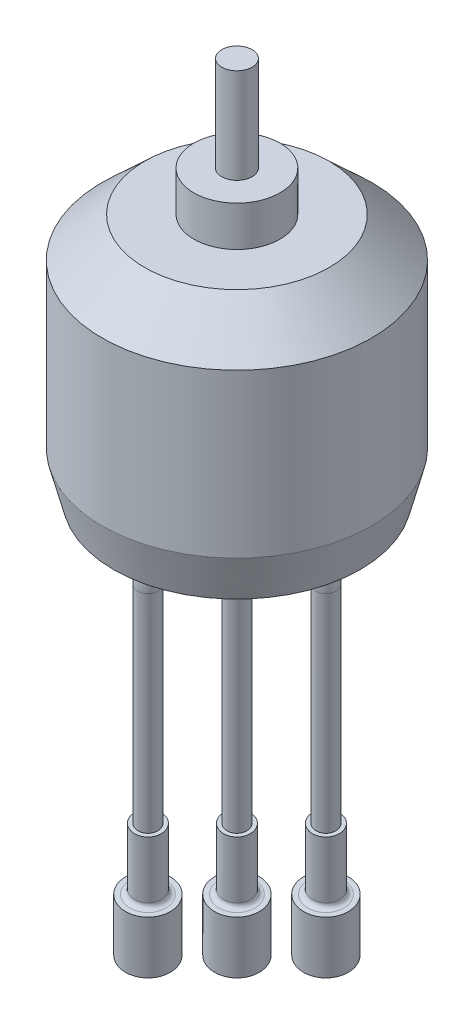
from build123d import *
from build123d.topology import SkipClean

# Parameters (mm, degrees)
TROU_TARAUD_M31_D              = 2.5
TROU_TARAUD_M31_DEPTH          = 5
TROU_TARAUD_M31_TIP            = 0.721687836
BOSS_EXTRU_1_REACH             = 55.963
BOSS_EXTRU_1_DIRECTION_2_DEPTH = 9
ESQUISSE6_R                    = 1.1
BOSS_EXTRU_2_DEPTH             = 10
ESQUISSE8_R                    = 1.1
ESQUISSE9_R                    = 1.5
BOSS_EXTRU_3_DEPTH             = 7
ESQUISSE10_R                   = 2.5
BOSS_EXTRU_4_DEPTH             = 6
CONG_1_R                       = 0.5
ESQUISSE11_R                   = 2.5
BOSS_EXTRU_5_DEPTH             = 6
BOSS_EXTRU_5_2_DEPTH           = 6
ESQUISSE12_R                   = 1.5
BOSS_EXTRU_6_DEPTH             = 7
CONG_2_R                       = 0.5
CONG_3_R                       = 0.5
ESQUISSE14_R                   = 1.1
ESQUISSE15_R                   = 1.1


with BuildPart() as part:
    # Esquisse1 → R_volution1 (revolve)
    with BuildSketch(Plane.XY, mode=Mode.PRIVATE) as r_volution1_sk:
        Polygon((0, 0), (0, 41), (1.57, 41), (1.57, 31.2), (4.45, 31.2), (4.45, 27.05), (9.525, 27.05), (13.925, 22.95), (13.925, 6.15), (12.75, 1.65), (1.57, 1.65), (1.57, 0), align=None)
    revolve(r_volution1_sk.sketch.rotate(Axis((0, 0, 0), (0, 1, 0)), 90), axis=Axis((0, 0, 0), (0, 1, 0)))

    # Trou taraud_ M31
    with Locations(Plane(origin=(0, 1.65, 0), x_dir=(-1, 0, 0), z_dir=(0, -1, 0))):
        with Locations((0, -8), (0, 8), (-9.5, 0), (9.5, 0)):
            Hole(TROU_TARAUD_M31_D / 2, depth=TROU_TARAUD_M31_DEPTH)
            with Locations((0, 0, -(TROU_TARAUD_M31_DEPTH + TROU_TARAUD_M31_TIP / 2))):  # 120° drill point
                Cone(0, TROU_TARAUD_M31_D / 2, TROU_TARAUD_M31_TIP, mode=Mode.SUBTRACT)


with BuildPart() as body_2:

    # Boss.-Extru.1: up to this face of the body
    boss_extru_1_end = part.part.faces().sort_by_distance((0, 3.9, 13.3375))[0]
    # Esquisse5 → Boss.-Extru.1 (new, up to the picked face)
    with BuildSketch(Plane(origin=(-8.154968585, -3.011359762, -8.154968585), x_dir=(-0.7293241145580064, 0.2369985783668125, 0.6418083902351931), z_dir=(-0.6841683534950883, -0.2526407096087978, -0.6841683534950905)), mode=Mode.PRIVATE) as boss_extru_1_sk1:
        with BuildLine():
            Line((0.027364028, 9.294064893), (4.390280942, 8.191814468))
            ThreePointArc((4.390280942, 8.191814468), (5.549629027, 6.248643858), (3.606458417, 5.089295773))
            Line((3.606458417, 5.089295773), (-0.756458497, 6.191546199))
            ThreePointArc((-0.756458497, 6.191546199), (-1.915806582, 8.134716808), (0.027364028, 9.294064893))
        make_face()
        with BuildLine():
            Line((-0.095108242, 8.809296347), (4.267808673, 7.707045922))
            ThreePointArc((4.267808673, 7.707045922), (5.064860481, 6.371116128), (3.728930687, 5.574064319))
            Line((3.728930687, 5.574064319), (-0.633986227, 6.676314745))
            ThreePointArc((-0.633986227, 6.676314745), (-1.431038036, 8.012244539), (-0.095108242, 8.809296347))
        make_face(mode=Mode.SUBTRACT)
    boss_extru_1_tool1 = split(extrude(boss_extru_1_sk1.sketch, amount=-BOSS_EXTRU_1_REACH, mode=Mode.PRIVATE), bisect_by=boss_extru_1_end, keep=Keep.BOTH, mode=Mode.PRIVATE)
    add(boss_extru_1_tool1.solids().sort_by(Axis((-6.81925, 4.165656, -12.140922), (0.6841683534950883, 0.2526407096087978, 0.6841683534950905)))[0])
    add(boss_extru_1_tool1.solids().sort_by(Axis((-6.81925, 4.165656, -12.140922), (0.6841683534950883, 0.2526407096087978, 0.6841683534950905)))[1])

    # Esquisse5 → Boss.-Extru.1 direction 2 (add)
    with BuildSketch(Plane(origin=(-8.154968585, -3.011359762, -8.154968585), x_dir=(-0.7293241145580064, 0.2369985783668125, 0.6418083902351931), z_dir=(-0.6841683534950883, -0.2526407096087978, -0.6841683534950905))):
        with BuildLine():
            Line((0.027364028, 9.294064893), (4.390280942, 8.191814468))
            ThreePointArc((4.390280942, 8.191814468), (5.549629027, 6.248643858), (3.606458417, 5.089295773))
            Line((3.606458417, 5.089295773), (-0.756458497, 6.191546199))
            ThreePointArc((-0.756458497, 6.191546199), (-1.915806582, 8.134716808), (0.027364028, 9.294064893))
        make_face()
        with BuildLine():
            Line((-0.095108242, 8.809296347), (4.267808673, 7.707045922))
            ThreePointArc((4.267808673, 7.707045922), (5.064860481, 6.371116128), (3.728930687, 5.574064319))
            Line((3.728930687, 5.574064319), (-0.633986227, 6.676314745))
            ThreePointArc((-0.633986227, 6.676314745), (-1.431038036, 8.012244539), (-0.095108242, 8.809296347))
        make_face(mode=Mode.SUBTRACT)
    extrude(amount=BOSS_EXTRU_1_DIRECTION_2_DEPTH)


with BuildPart() as part_1:
    add(part.part)

    add(body_2.part)  # Boss.-Extru.2 merges body 2
    # Esquisse6 → Boss.-Extru.2 (add)
    with BuildSketch(Plane(origin=(-8.154968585, -3.011359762, -8.154968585), x_dir=(-0.7293241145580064, 0.2369985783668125, 0.6418083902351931), z_dir=(-0.6841683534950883, -0.2526407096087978, -0.6841683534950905))):
        with Locations(Location((-0.364547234, 7.742805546, 0), (0, 0, 255.821443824))):
            Circle(ESQUISSE6_R)
        with Locations(Location((3.99836968, 6.640555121, 0), (0, 0, 75.821443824))):
            Circle(ESQUISSE6_R)
        with Locations(Location((1.816911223, 7.191680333, 0), (0, 0, 345.821443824))):
            Circle(ESQUISSE6_R)
    extrude(amount=BOSS_EXTRU_2_DEPTH)

    # Balayage1: sweep along a path in Esquisse7
    with BuildLine(Plane(origin=(0, 0, 0), x_dir=(0.7071067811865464, 0, 0.7071067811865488), z_dir=(-0.7071067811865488, 0, 0.7071067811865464))) as balayage1_path:
        Line((-27, -46.5), (-24, -22))
        ThreePointArc((-24, -22), (-24.028124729, -19.84813952), (-24.62883423, -17.78163459))
        Line((-24.62883423, -17.78163459), (-28.373198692, -9.34726787))
        ThreePointArc((-28.373198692, -9.34726787), (-28.269117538, -2.630213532), (-23.08246749, 1.639249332))
    # Esquisse8 → Balayage1 (sweep)
    with BuildSketch(Plane(origin=(-14.99665212, -5.537766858, -14.99665212), x_dir=(-0.6418083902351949, -0.23699857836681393, 0.7293241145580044), z_dir=(-0.6841683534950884, -0.25264070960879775, -0.6841683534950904))):
        with Locations((-1.816911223, 7.191680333)):
            Circle(ESQUISSE8_R)
    sweep(path=balayage1_path.line)

    # Esquisse9 → Boss.-Extru.3 (add)
    with BuildSketch(Plane(origin=(-4.248733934, -49.07037341, -4.248733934), x_dir=(0.9962936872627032, -0.08593095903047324, -0.00384174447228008), z_dir=(-0.08594259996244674, -0.992586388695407, -0.08594259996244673))):
        with Locations(Location((-14.951986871, -14.956037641, 0), (0, 0, 0.220933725))):
            Circle(ESQUISSE9_R)
    extrude(amount=BOSS_EXTRU_3_DEPTH)

    # Esquisse10 → Boss.-Extru.4 (add)
    with BuildSketch(Plane(origin=(-4.850332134, -56.018478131, -4.850332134), x_dir=(0.9962936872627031, -0.08593095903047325, -0.0038417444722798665), z_dir=(-0.08594259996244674, -0.992586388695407, -0.08594259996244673))):
        with Locations(Location((-14.951986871, -14.956037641, 0), (0, 0, 180.220933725))):
            Circle(ESQUISSE10_R)
    extrude(amount=BOSS_EXTRU_4_DEPTH)

    # Cong_1
    cong_1_edges = [part_1.edges().sort_by_distance(p)[0] for p in [
        (-21.187890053, -53.31871208, -19.693481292),
    ]]
    fillet(cong_1_edges, radius=CONG_1_R)



with BuildPart() as body_2_2:
    # Esquisse11 → Boss.-Extru.5 (new body)
    with BuildSketch(Plane(origin=(-5.365987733, -61.973996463, -5.365987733), x_dir=(0.9962936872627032, -0.08593095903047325, -0.0038417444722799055), z_dir=(-0.08594259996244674, -0.9925863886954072, -0.08594259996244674))):
        with Locations(Location((-19.54880342, -10.360466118, 0), (0, 0, 269.79458666))):
            Circle(ESQUISSE11_R)
    extrude(amount=-BOSS_EXTRU_5_DEPTH)



with BuildPart() as body_3:
    # Esquisse11 → Boss.-Extru.5 2 (new body)
    with BuildSketch(Plane(origin=(-5.365987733, -61.973996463, -5.365987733), x_dir=(0.9962936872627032, -0.08593095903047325, -0.0038417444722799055), z_dir=(-0.08594259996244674, -0.9925863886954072, -0.08594259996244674))):
        with Locations(Location((-10.355170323, -19.551609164, 0), (0, 0, 269.79458666))):
            Circle(ESQUISSE11_R)
    extrude(amount=-BOSS_EXTRU_5_2_DEPTH)


with BuildPart() as body_2_2_1:
    add(body_2_2.part)

    add(body_3.part)  # Boss.-Extru.6 merges body 3
    # Esquisse12 → Boss.-Extru.6 (add)
    with BuildSketch(Plane(origin=(-4.850332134, -56.018478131, -4.850332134), x_dir=(0.9962936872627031, -0.08593095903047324, -0.003841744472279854), z_dir=(0.08594259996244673, 0.992586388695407, 0.08594259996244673))):
        with Locations(Location((-19.54880342, 10.360466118, 0), (0, 0, 90.20541334))):
            Circle(ESQUISSE12_R)
        with Locations(Location((-10.355170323, 19.551609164, 0), (0, 0, 90.20541334))):
            Circle(ESQUISSE12_R)
    extrude(amount=BOSS_EXTRU_6_DEPTH)

    # Cong_2
    cong_2_edges = [body_2_2_1.edges().sort_by_distance(p)[0] for p in [
        (-24.289675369, -53.577497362, -13.602878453),
    ]]
    fillet(cong_2_edges, radius=CONG_2_R)

    # Cong_3
    cong_3_edges = [body_2_2_1.edges().sort_by_distance(p)[0] for p in [
        (-15.097287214, -53.577497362, -22.795266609),
    ]]
    fillet(cong_3_edges, radius=CONG_3_R)


with BuildPart() as part_2:
    with SkipClean():  # the faces are left unmerged after this step: merging them gives an invalid solid
        add(part_1.part)

        add(body_2_2_1.part)  # Balayage3 merges body 2 2
        # Balayage3: sweep along a curve in space
        with BuildLine() as balayage3_path:
            Line((-14.495689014, -46.5, -23.68807717), (-12.464443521, -23.040311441, -21.656831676))
            ThreePointArc((-12.464443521, -23.040311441, -21.656831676), (-12.56702089, -20.751749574, -21.595478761), (-13.256180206, -18.576337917, -21.806299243))
            Line((-13.256180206, -18.576337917, -21.806299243), (-17.601967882, -9.332613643, -23.346892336))
            ThreePointArc((-17.601967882, -9.332613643, -23.346892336), (-18.406100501, -2.727632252, -22.366329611), (-15.115429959, 1.497210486, -18.297410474))
            Line((-15.115429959, 1.497210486, -18.297410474), (-14.730779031, 1.639249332, -17.912759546))
        # Esquisse14 → Balayage3 (sweep)
        with BuildSketch(Plane(origin=(-14.99665212, -5.537766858, -14.99665212), x_dir=(-0.6418083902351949, -0.23699857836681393, 0.7293241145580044), z_dir=(-0.6841683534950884, -0.25264070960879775, -0.6841683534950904))):
            with Locations((-3.99836968, 6.640555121)):
                Circle(ESQUISSE14_R)
        sweep(path=balayage3_path.line)

    # Balayage4: sweep along a curve in space
    with BuildLine() as balayage4_path:
        Line((-17.912759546, 1.639249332, -14.730779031), (-18.297410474, 1.497210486, -15.115429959))
        ThreePointArc((-18.297410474, 1.497210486, -15.115429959), (-22.366329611, -2.727632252, -18.406100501), (-23.346892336, -9.332613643, -17.601967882))
        Line((-23.346892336, -9.332613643, -17.601967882), (-21.806299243, -18.576337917, -13.256180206))
        ThreePointArc((-21.806299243, -18.576337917, -13.256180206), (-21.595478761, -20.751749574, -12.56702089), (-21.656831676, -23.040311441, -12.464443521))
        Line((-21.656831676, -23.040311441, -12.464443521), (-23.68807717, -46.5, -14.495689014))
    # Esquisse15 → Balayage4 (sweep)
    with BuildSketch(Plane(origin=(-14.99665212, -5.537766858, -14.99665212), x_dir=(-0.6418083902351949, -0.23699857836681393, 0.7293241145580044), z_dir=(-0.6841683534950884, -0.25264070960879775, -0.6841683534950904))):
        with Locations((0.364547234, 7.742805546)):
            Circle(ESQUISSE15_R)
    sweep(path=balayage4_path.line)


solid = part_2.part
